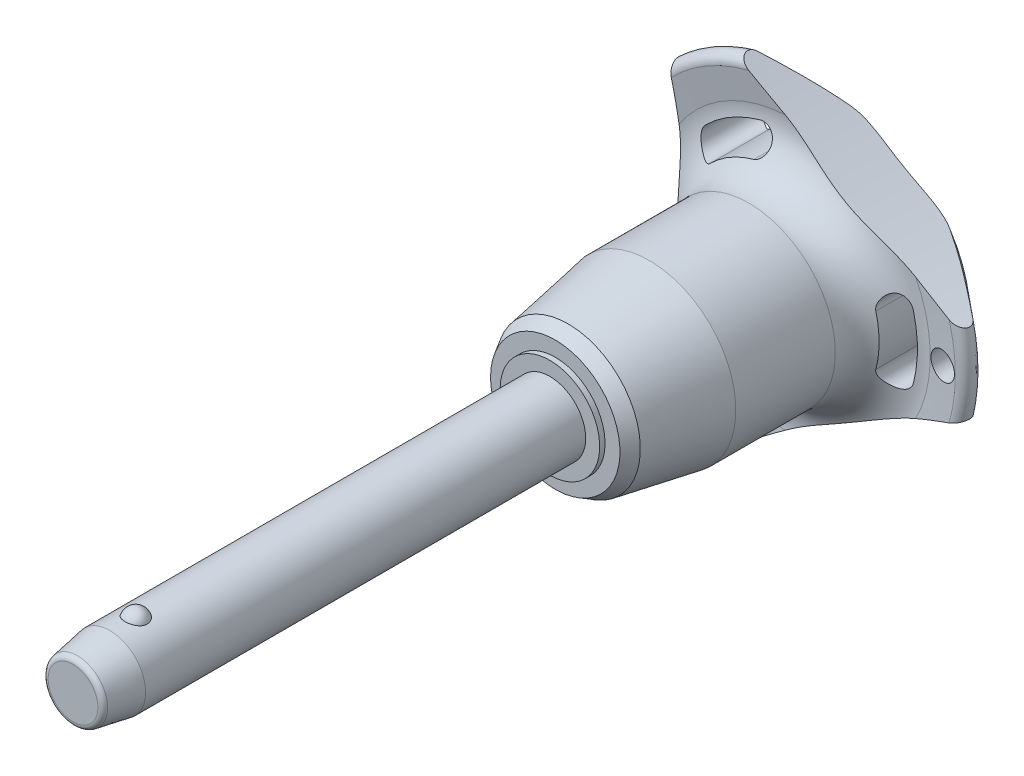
from build123d import *

# Parameters (mm, degrees)
SKETCH1_R           = 4
BOSS_EXTRUDE1_DEPTH = 45
SKETCH2_R           = 3.4
BOSS_EXTRUDE2_DEPTH = 33.3
BOSS_EXTRUDE3_START = 8.2
SKETCH1_2_R         = 4
BOSS_EXTRUDE3_DEPTH = 8.2
CHAMFER1_SIZE       = 4.1
CHAMFER1_SIZE2      = 0.722940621
FILLET1_R           = 0.6
SKETCH6_R           = 102.8
CUT_EXTRUDE1_DEPTH  = 84.064879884
CIRPATTERN1_COUNT   = 3
SKETCH7_R           = 1.5
CUT_EXTRUDE2_DEPTH  = 83.869938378


with BuildPart() as part:
    # Sketch1 → Boss-Extrude1 (new body)
    with BuildSketch(Plane.XY):
        Circle(SKETCH1_R)
    extrude(amount=-BOSS_EXTRUDE1_DEPTH)

    # Sketch2 → Boss-Extrude2 (add)
    with BuildSketch(Plane(origin=(0, 0, -45), x_dir=(-1, 0, 0), z_dir=(0, 0, -1))):
        Circle(SKETCH2_R)
    extrude(amount=BOSS_EXTRUDE2_DEPTH)

    # Sketch3 → Revolve1 (revolve)
    with BuildSketch(Plane(origin=(0, 0, 0), x_dir=(0, 0, -1), z_dir=(1, 0, 0))):
        with BuildLine():
            Line((-1.2, 4.8), (-1.2, 2.2))
            ThreePointArc((-1.2, 2.2), (0.1, 3.5), (-1.2, 4.8))
        make_face()
        with BuildLine():
            Line((-1.2, -2.2), (-1.2, -4.8))
            ThreePointArc((-1.2, -4.8), (0.1, -3.5), (-1.2, -2.2))
        make_face()
    revolve(axis=Axis((0, -2.2, 1.2), (0, 1, 0)))

    # Sketch1_2 → Boss-Extrude3 (add)
    with BuildSketch(Plane.XY.offset(BOSS_EXTRUDE3_START)):
        Circle(SKETCH1_2_R)
    extrude(amount=-BOSS_EXTRUDE3_DEPTH)

    # Chamfer1
    chamfer1_edges = [part.edges().sort_by_distance(p)[0] for p in [
        (-4, 0, 8.2),
    ]]
    chamfer1_side = [part.faces().sort_by_distance(p)[0] for p in [
        (-4, 0, -18.4),
    ]]
    chamfer(chamfer1_edges, length=CHAMFER1_SIZE, length2=CHAMFER1_SIZE2, reference=chamfer1_side[0])

    # Fillet1
    fillet1_edges = [part.edges().sort_by_distance(p)[0] for p in [
        (-3.277059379, 0, 8.2),
        (3.4, 0, -78.3),
    ]]
    fillet(fillet1_edges, radius=FILLET1_R)

    # Sketch4 → Revolve2 (revolve)
    with BuildSketch(Plane(origin=(0, 0, 0), x_dir=(0, 0, -1), z_dir=(1, 0, 0)), mode=Mode.PRIVATE) as revolve2_sk:
        Polygon((45, 0), (45, 5.554101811), (45.6, 5.554101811), (45.6, 7.220004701), (47.042714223, 8.052956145), (56.1, 9.65), (67.2, 9.65), (67.2, 0), align=None)
    revolve(revolve2_sk.sketch.rotate(Axis((0, 0, -67.2), (0, 0, 1)), 90), axis=Axis((0, 0, -67.2), (0, 0, 1)))

    # Sketch5 → Revolve3 (revolve)
    with BuildSketch(Plane(origin=(0, 0, 0), x_dir=(0, 0, -1), z_dir=(1, 0, 0)), mode=Mode.PRIVATE) as revolve3_sk:
        with BuildLine():
            Line((72.16082631, 15.274661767), (71.757834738, 18.475067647))
            ThreePointArc((71.757834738, 18.475067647), (72.349836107, 19.516443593), (73.516044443, 19.24278761))
            Line((73.516044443, 19.24278761), (77.835691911, 14.094832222))
            ThreePointArc((77.835691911, 14.094832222), (78.3, 12.689260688), (77.67067517, 11.349423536))
            ThreePointArc((77.67067517, 11.349423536), (74.033110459, 6.185112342), (72.75, 0))
            Line((72.75, 0), (67.2, 0))
            Line((67.2, 0), (67.2, 9.65))
            ThreePointArc((67.2, 9.65), (70.949887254, 11.342683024), (72.16082631, 15.274661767))
        make_face()
    revolve(revolve3_sk.sketch.rotate(Axis((0, 0, -72.75), (0, 0, 1)), 90), axis=Axis((0, 0, -72.75), (0, 0, 1)))

    # Sketch6 → Cut-Extrude1 (cut, through all)
    with BuildSketch(Plane.XY):
        with Locations((-115.2, 0)):
            Circle(SKETCH6_R)
        with BuildLine():
            ThreePointArc((13.411913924, -3.529271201), (13.868496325, 0), (13.411913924, 3.529271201))
            ThreePointArc((13.411913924, 3.529271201), (11.694200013, 4.531299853), (10.692171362, 2.813585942))
            ThreePointArc((10.692171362, 2.813585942), (11.056165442, 0), (10.692171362, -2.813585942))
            ThreePointArc((10.692171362, -2.813585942), (11.694200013, -4.531299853), (13.411913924, -3.529271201))
        make_face()
    cut_extrude1 = extrude(amount=-CUT_EXTRUDE1_DEPTH, mode=Mode.SUBTRACT)

    # CirPattern1: Cut-Extrude1 ×3 about axis
    cirpattern1_axis = Axis((0, 0, 0), (0, 0, 1))
    for i in range(1, CIRPATTERN1_COUNT):
        add(cut_extrude1.rotate(cirpattern1_axis, i * 360 / CIRPATTERN1_COUNT), mode=Mode.SUBTRACT)

    # Sketch7 → Cut-Extrude2 (cut, through all)
    with BuildSketch(Plane.XY):
        with Locations(Location((16.868496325, 0, 0), (0, 0, 225.467095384))):
            Circle(SKETCH7_R)
    extrude(amount=-CUT_EXTRUDE2_DEPTH, mode=Mode.SUBTRACT)


solid = part.part
